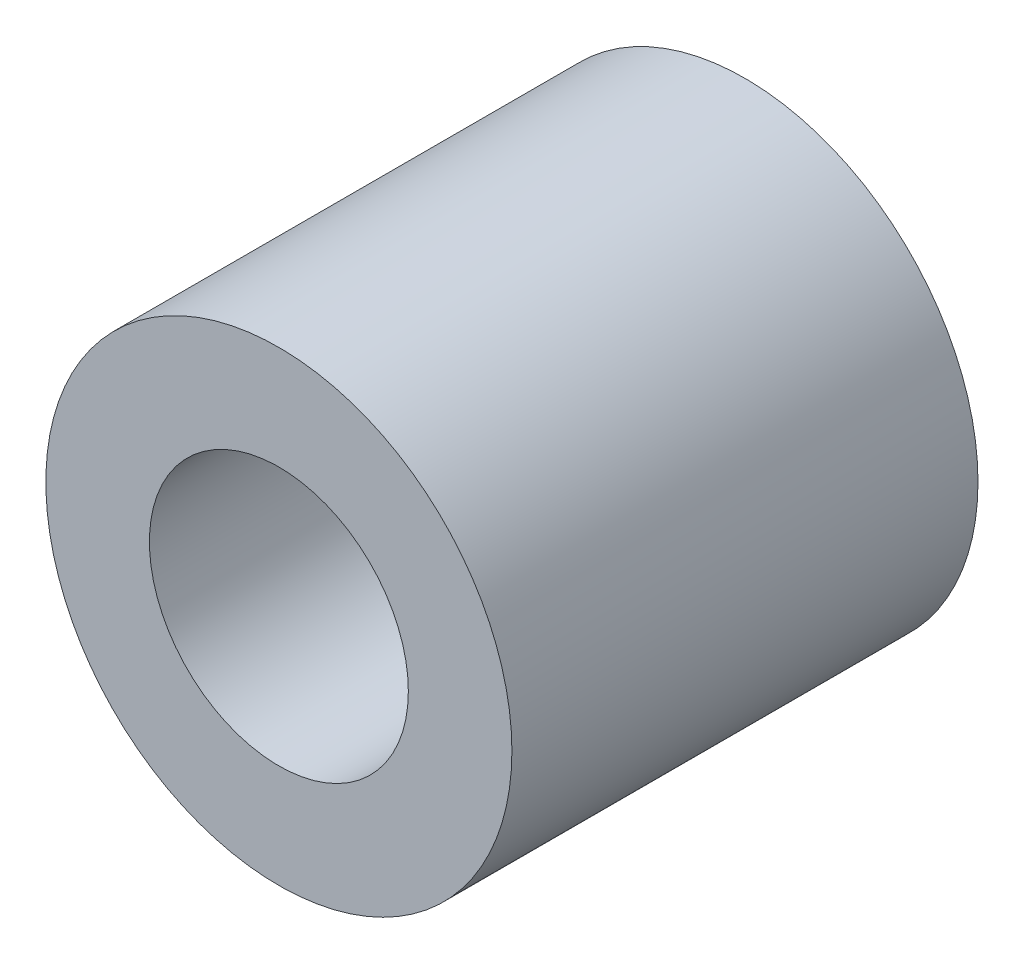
ISO-10303-21;
HEADER;
FILE_DESCRIPTION(('STEP AP214'),'2;1');
FILE_NAME('part.step','',(''),(''),'','','');
FILE_SCHEMA(('AUTOMOTIVE_DESIGN { 1 0 10303 214 1 1 1 1 }'));
ENDSEC;
DATA;
#1=APPLICATION_CONTEXT('core data for automotive mechanical design processes');
#2=APPLICATION_PROTOCOL_DEFINITION('international standard','automotive_design',2000,#1);
#3=PRODUCT_CONTEXT('',#1,'mechanical');
#4=PRODUCT('Part','Part','',(#3));
#5=PRODUCT_RELATED_PRODUCT_CATEGORY('part','',(#4));
#6=PRODUCT_DEFINITION_FORMATION('','',#4);
#7=PRODUCT_DEFINITION_CONTEXT('part definition',#1,'design');
#8=PRODUCT_DEFINITION('design','',#6,#7);
#9=PRODUCT_DEFINITION_SHAPE('','',#8);
#10=(LENGTH_UNIT() NAMED_UNIT(*) SI_UNIT(.MILLI.,.METRE.));
#11=(NAMED_UNIT(*) PLANE_ANGLE_UNIT() SI_UNIT($,.RADIAN.));
#12=(NAMED_UNIT(*) SI_UNIT($,.STERADIAN.) SOLID_ANGLE_UNIT());
#13=UNCERTAINTY_MEASURE_WITH_UNIT(LENGTH_MEASURE(1.E-05),#10,'distance_accuracy_value','');
#14=(GEOMETRIC_REPRESENTATION_CONTEXT(3) GLOBAL_UNCERTAINTY_ASSIGNED_CONTEXT((#13)) GLOBAL_UNIT_ASSIGNED_CONTEXT((#10,
#11,#12)) REPRESENTATION_CONTEXT('',''));
#15=CARTESIAN_POINT('',(0.,0.,0.));
#16=DIRECTION('',(0.,0.,1.));
#17=DIRECTION('',(1.,0.,0.));
#18=AXIS2_PLACEMENT_3D('',#15,#16,#17);
#19=CARTESIAN_POINT('',(0.,0.,8.99999999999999));
#20=DIRECTION('',(0.,0.,-1.));
#21=DIRECTION('',(-1.,0.,0.));
#22=AXIS2_PLACEMENT_3D('',#19,#20,#21);
#23=CYLINDRICAL_SURFACE('',#22,4.5);
#24=CARTESIAN_POINT('',(0.,0.,8.99999999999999));
#25=DIRECTION('',(0.,0.,1.));
#26=DIRECTION('',(1.,0.,0.));
#27=AXIS2_PLACEMENT_3D('',#24,#25,#26);
#28=CIRCLE('',#27,4.5);
#29=CARTESIAN_POINT('',(4.5,0.,8.99999999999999));
#30=VERTEX_POINT('',#29);
#31=EDGE_CURVE('E10',#30,#30,#28,.T.);
#32=ORIENTED_EDGE('',*,*,#31,.F.);
#33=EDGE_LOOP('',(#32));
#34=FACE_BOUND('',#33,.T.);
#35=CARTESIAN_POINT('',(0.,0.,0.));
#36=DIRECTION('',(0.,0.,1.));
#37=DIRECTION('',(1.,0.,0.));
#38=AXIS2_PLACEMENT_3D('',#35,#36,#37);
#39=CIRCLE('',#38,4.5);
#40=CARTESIAN_POINT('',(4.5,0.,0.));
#41=VERTEX_POINT('',#40);
#42=EDGE_CURVE('E42',#41,#41,#39,.T.);
#43=ORIENTED_EDGE('',*,*,#42,.T.);
#44=EDGE_LOOP('',(#43));
#45=FACE_BOUND('',#44,.T.);
#46=ADVANCED_FACE('F36',(#34,#45),#23,.T.);
#47=CARTESIAN_POINT('',(0.,0.,8.99999999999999));
#48=DIRECTION('',(0.,0.,1.));
#49=DIRECTION('',(1.,0.,0.));
#50=AXIS2_PLACEMENT_3D('',#47,#48,#49);
#51=PLANE('',#50);
#52=CARTESIAN_POINT('',(0.,0.,8.99999999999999));
#53=DIRECTION('',(0.,0.,1.));
#54=DIRECTION('',(1.,0.,0.));
#55=AXIS2_PLACEMENT_3D('',#52,#53,#54);
#56=CIRCLE('',#55,2.5);
#57=CARTESIAN_POINT('',(2.5,0.,8.99999999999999));
#58=VERTEX_POINT('',#57);
#59=EDGE_CURVE('E50',#58,#58,#56,.T.);
#60=ORIENTED_EDGE('',*,*,#59,.F.);
#61=EDGE_LOOP('',(#60));
#62=FACE_BOUND('',#61,.T.);
#63=ORIENTED_EDGE('',*,*,#31,.T.);
#64=EDGE_LOOP('',(#63));
#65=FACE_BOUND('',#64,.T.);
#66=ADVANCED_FACE('F78',(#62,#65),#51,.T.);
#67=CARTESIAN_POINT('',(0.,0.,0.));
#68=DIRECTION('',(0.,0.,1.));
#69=DIRECTION('',(1.,0.,0.));
#70=AXIS2_PLACEMENT_3D('',#67,#68,#69);
#71=PLANE('',#70);
#72=CARTESIAN_POINT('',(0.,0.,0.));
#73=DIRECTION('',(0.,0.,1.));
#74=DIRECTION('',(1.,0.,0.));
#75=AXIS2_PLACEMENT_3D('',#72,#73,#74);
#76=CIRCLE('',#75,1.75);
#77=CARTESIAN_POINT('',(1.75,0.,0.));
#78=VERTEX_POINT('',#77);
#79=EDGE_CURVE('E55',#78,#78,#76,.F.);
#80=ORIENTED_EDGE('',*,*,#79,.F.);
#81=EDGE_LOOP('',(#80));
#82=FACE_BOUND('',#81,.T.);
#83=ORIENTED_EDGE('',*,*,#42,.F.);
#84=EDGE_LOOP('',(#83));
#85=FACE_BOUND('',#84,.T.);
#86=ADVANCED_FACE('F70',(#82,#85),#71,.F.);
#87=CARTESIAN_POINT('',(0.,0.,4.7));
#88=DIRECTION('',(0.,0.,1.));
#89=DIRECTION('',(1.,0.,0.));
#90=AXIS2_PLACEMENT_3D('',#87,#88,#89);
#91=CYLINDRICAL_SURFACE('',#90,2.5);
#92=CARTESIAN_POINT('',(0.,0.,4.7));
#93=DIRECTION('',(0.,0.,1.));
#94=DIRECTION('',(1.,0.,0.));
#95=AXIS2_PLACEMENT_3D('',#92,#93,#94);
#96=CIRCLE('',#95,2.5);
#97=CARTESIAN_POINT('',(2.5,0.,4.7));
#98=VERTEX_POINT('',#97);
#99=EDGE_CURVE('E46',#98,#98,#96,.T.);
#100=CARTESIAN_POINT('',(2.5,0.,4.7));
#101=CARTESIAN_POINT('',(2.5,0.,4.74479166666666));
#102=CARTESIAN_POINT('',(2.5,0.,4.78958333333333));
#103=CARTESIAN_POINT('',(2.5,0.,4.87916666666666));
#104=CARTESIAN_POINT('',(2.5,0.,4.92395833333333));
#105=CARTESIAN_POINT('',(2.5,0.,5.01354166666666));
#106=CARTESIAN_POINT('',(2.5,0.,5.05833333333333));
#107=CARTESIAN_POINT('',(2.5,0.,5.14791666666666));
#108=CARTESIAN_POINT('',(2.5,0.,5.19270833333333));
#109=CARTESIAN_POINT('',(2.5,0.,5.28229166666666));
#110=CARTESIAN_POINT('',(2.5,0.,5.32708333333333));
#111=CARTESIAN_POINT('',(2.5,0.,5.41666666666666));
#112=CARTESIAN_POINT('',(2.5,0.,5.46145833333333));
#113=CARTESIAN_POINT('',(2.5,0.,5.55104166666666));
#114=CARTESIAN_POINT('',(2.5,0.,5.59583333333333));
#115=CARTESIAN_POINT('',(2.5,0.,5.68541666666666));
#116=CARTESIAN_POINT('',(2.5,0.,5.73020833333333));
#117=CARTESIAN_POINT('',(2.5,0.,5.81979166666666));
#118=CARTESIAN_POINT('',(2.5,0.,5.86458333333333));
#119=CARTESIAN_POINT('',(2.5,0.,5.95416666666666));
#120=CARTESIAN_POINT('',(2.5,0.,5.99895833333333));
#121=CARTESIAN_POINT('',(2.5,0.,6.08854166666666));
#122=CARTESIAN_POINT('',(2.5,0.,6.13333333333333));
#123=CARTESIAN_POINT('',(2.5,0.,6.22291666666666));
#124=CARTESIAN_POINT('',(2.5,0.,6.26770833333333));
#125=CARTESIAN_POINT('',(2.5,0.,6.35729166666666));
#126=CARTESIAN_POINT('',(2.5,0.,6.40208333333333));
#127=CARTESIAN_POINT('',(2.5,0.,6.49166666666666));
#128=CARTESIAN_POINT('',(2.5,0.,6.53645833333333));
#129=CARTESIAN_POINT('',(2.5,0.,6.62604166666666));
#130=CARTESIAN_POINT('',(2.5,0.,6.67083333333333));
#131=CARTESIAN_POINT('',(2.5,0.,6.76041666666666));
#132=CARTESIAN_POINT('',(2.5,0.,6.80520833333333));
#133=CARTESIAN_POINT('',(2.5,0.,6.89479166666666));
#134=CARTESIAN_POINT('',(2.5,0.,6.93958333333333));
#135=CARTESIAN_POINT('',(2.5,0.,7.02916666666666));
#136=CARTESIAN_POINT('',(2.5,0.,7.07395833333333));
#137=CARTESIAN_POINT('',(2.5,0.,7.16354166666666));
#138=CARTESIAN_POINT('',(2.5,0.,7.20833333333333));
#139=CARTESIAN_POINT('',(2.5,0.,7.29791666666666));
#140=CARTESIAN_POINT('',(2.5,0.,7.34270833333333));
#141=CARTESIAN_POINT('',(2.5,0.,7.43229166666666));
#142=CARTESIAN_POINT('',(2.5,0.,7.47708333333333));
#143=CARTESIAN_POINT('',(2.5,0.,7.56666666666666));
#144=CARTESIAN_POINT('',(2.5,0.,7.61145833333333));
#145=CARTESIAN_POINT('',(2.5,0.,7.70104166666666));
#146=CARTESIAN_POINT('',(2.5,0.,7.74583333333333));
#147=CARTESIAN_POINT('',(2.5,0.,7.83541666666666));
#148=CARTESIAN_POINT('',(2.5,0.,7.88020833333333));
#149=CARTESIAN_POINT('',(2.5,0.,7.96979166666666));
#150=CARTESIAN_POINT('',(2.5,0.,8.01458333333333));
#151=CARTESIAN_POINT('',(2.5,0.,8.10416666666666));
#152=CARTESIAN_POINT('',(2.5,0.,8.14895833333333));
#153=CARTESIAN_POINT('',(2.5,0.,8.23854166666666));
#154=CARTESIAN_POINT('',(2.5,0.,8.28333333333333));
#155=CARTESIAN_POINT('',(2.5,0.,8.37291666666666));
#156=CARTESIAN_POINT('',(2.5,0.,8.41770833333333));
#157=CARTESIAN_POINT('',(2.5,0.,8.50729166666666));
#158=CARTESIAN_POINT('',(2.5,0.,8.55208333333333));
#159=CARTESIAN_POINT('',(2.5,0.,8.64166666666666));
#160=CARTESIAN_POINT('',(2.5,0.,8.68645833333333));
#161=CARTESIAN_POINT('',(2.5,0.,8.77604166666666));
#162=CARTESIAN_POINT('',(2.5,0.,8.82083333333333));
#163=CARTESIAN_POINT('',(2.5,0.,8.91041666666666));
#164=CARTESIAN_POINT('',(2.5,0.,8.95520833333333));
#165=CARTESIAN_POINT('',(2.5,0.,8.99999999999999));
#166=B_SPLINE_CURVE_WITH_KNOTS('',3,(#100,#101,#102,#103,#104,#105,#106,#107,#108,#109,#110,
#111,#112,#113,#114,#115,#116,#117,#118,#119,#120,#121,#122,#123,#124,#125,#126,#127,#128,#129,
#130,#131,#132,#133,#134,#135,#136,#137,#138,#139,#140,#141,#142,#143,#144,#145,#146,#147,#148,
#149,#150,#151,#152,#153,#154,#155,#156,#157,#158,#159,#160,#161,#162,#163,#164,#165),
.UNSPECIFIED.,.F.,.F.,(4,2,2,2,2,2,2,2,2,2,2,2,2,2,2,2,2,2,2,2,2,2,2,2,2,2,2,2,2,2,2,2,4),(0.,
0.134374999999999,0.268749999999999,0.403124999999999,0.537499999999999,0.671874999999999,
0.806249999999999,0.940624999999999,1.075,1.209375,1.34375,1.478125,1.6125,1.746875,1.88125,
2.015625,2.15,2.284375,2.41875,2.553125,2.6875,2.821875,2.95625,3.090625,3.225,3.359375,3.49375,
3.628125,3.7625,3.896875,4.03125,4.165625,4.3),.UNSPECIFIED.);
#167=EDGE_CURVE('BSEAM68',#98,#58,#166,.T.);
#168=ORIENTED_EDGE('',*,*,#99,.F.);
#169=ORIENTED_EDGE('',*,*,#59,.T.);
#170=ORIENTED_EDGE('',*,*,#167,.T.);
#171=ORIENTED_EDGE('',*,*,#167,.F.);
#172=EDGE_LOOP('',(#168,#170,#169,#171));
#173=FACE_BOUND('',#172,.T.);
#174=ADVANCED_FACE('F68',(#173),#91,.F.);
#175=CARTESIAN_POINT('',(0.,0.,4.7));
#176=DIRECTION('',(0.,0.,1.));
#177=DIRECTION('',(1.,0.,0.));
#178=AXIS2_PLACEMENT_3D('',#175,#176,#177);
#179=PLANE('',#178);
#180=CARTESIAN_POINT('',(0.,0.,4.7));
#181=DIRECTION('',(0.,0.,1.));
#182=DIRECTION('',(1.,0.,0.));
#183=AXIS2_PLACEMENT_3D('',#180,#181,#182);
#184=CIRCLE('',#183,1.75);
#185=CARTESIAN_POINT('',(1.75,0.,4.7));
#186=VERTEX_POINT('',#185);
#187=EDGE_CURVE('E58',#186,#186,#184,.T.);
#188=ORIENTED_EDGE('',*,*,#187,.F.);
#189=EDGE_LOOP('',(#188));
#190=FACE_BOUND('',#189,.T.);
#191=ORIENTED_EDGE('',*,*,#99,.T.);
#192=EDGE_LOOP('',(#191));
#193=FACE_BOUND('',#192,.T.);
#194=ADVANCED_FACE('F65',(#190,#193),#179,.T.);
#195=CARTESIAN_POINT('',(0.,0.,-0.001000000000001));
#196=DIRECTION('',(0.,0.,1.));
#197=DIRECTION('',(1.,0.,0.));
#198=AXIS2_PLACEMENT_3D('',#195,#196,#197);
#199=CYLINDRICAL_SURFACE('',#198,1.75);
#200=ORIENTED_EDGE('',*,*,#187,.T.);
#201=EDGE_LOOP('',(#200));
#202=FACE_BOUND('',#201,.T.);
#203=ORIENTED_EDGE('',*,*,#79,.T.);
#204=EDGE_LOOP('',(#203));
#205=FACE_BOUND('',#204,.T.);
#206=ADVANCED_FACE('F62',(#202,#205),#199,.F.);
#207=CLOSED_SHELL('',(#46,#66,#86,#174,#194,#206));
#208=MANIFOLD_SOLID_BREP('B2',#207);
#209=ADVANCED_BREP_SHAPE_REPRESENTATION('',(#18,#208),#14);
#210=SHAPE_DEFINITION_REPRESENTATION(#9,#209);
ENDSEC;
END-ISO-10303-21;
